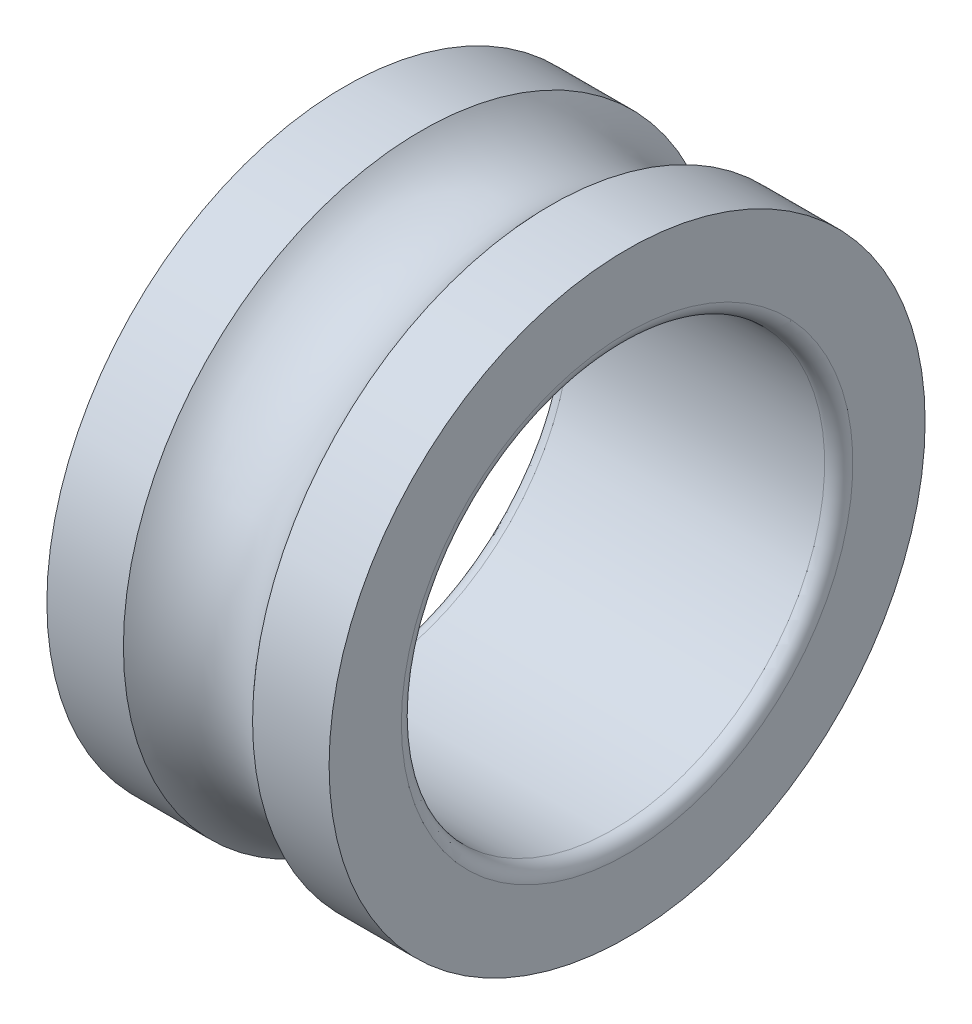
from build123d import *


with BuildPart() as part:
    # Esquisse1 → R_volution1 (revolve)
    with BuildSketch(Plane.XY, mode=Mode.PRIVATE) as r_volution1_sk:
        with BuildLine():
            Line((0, 8.448), (0, 6.4))
            ThreePointArc((0, 6.4), (0.117157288, 6.117157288), (0.4, 6))
            Line((0.4, 6), (7.6, 6))
            ThreePointArc((7.6, 6), (7.882842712, 6.117157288), (8, 6.4))
            Line((8, 6.4), (8, 8.448))
            Line((8, 8.448), (5.830654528, 8.448))
            ThreePointArc((5.830654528, 8.448), (4, 7.6), (2.169345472, 8.448))
            Line((2.169345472, 8.448), (0, 8.448))
        make_face()
    revolve(r_volution1_sk.sketch.rotate(Axis((8, 0, 0), (-1, 0, 0)), 270), axis=Axis((8, 0, 0), (-1, 0, 0)))


solid = part.part
